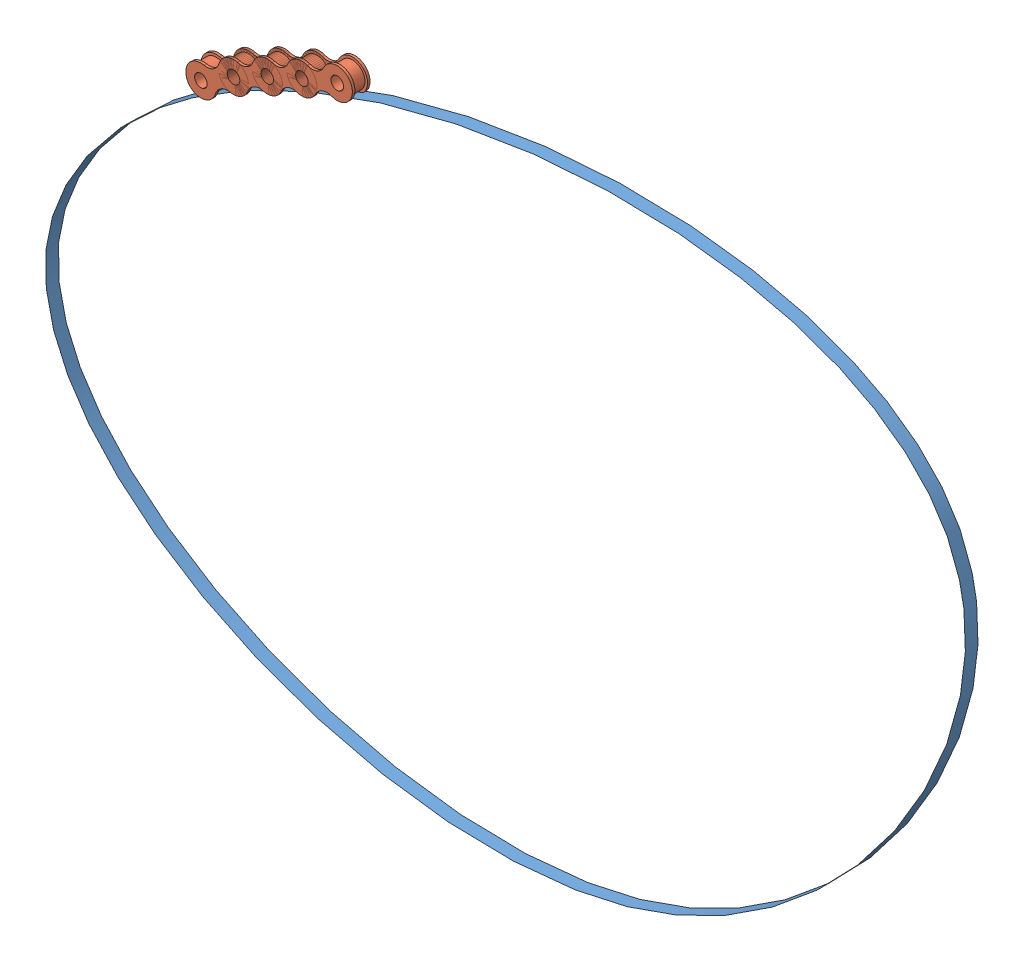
SolidWorks assembly kette.SLDASM, configuration Standard (file format 3400). Lengths in mm.
Overall size (516.33 352.17 7).
5 component instances, 2 part files, 12 mates.
Components (placement in the parent):
- BAHN-1: BAHN.SLDPRT [Standard] at (-3.7535 106.7741 0) size (516.33 352.17 5)
- KETTENGLIED-1: KETTENGLIED.SLDPRT [Standard] at (-120.4671 168.6904 3.5) x (0.860014 0.51027 0) z (0 0 1) size (27 12 7)
- KETTENGLIED-2: KETTENGLIED.SLDPRT [Standard] at (-107.5669 176.3444 3.5) x (0.889024 0.457861 0) z (0 0 1) size (27 12 7)
- KETTENGLIED-3: KETTENGLIED.SLDPRT [Standard] at (-94.2316 183.2123 3.5) x (0.912863 0.408267 0) z (0 0 1) size (27 12 7)
- KETTENGLIED-4: KETTENGLIED.SLDPRT [Standard] at (-80.5386 189.3363 3.5) x (0.932534 0.361081 0) z (0 0 1) size (27 12 7)
Mates (geometry in assembly coordinates):
- Deckungsgleich1: coincident anti-aligned: plane of KETTENGLIED-1 through (-102.2179 152.631 0) normal (0 0 -1)
- Deckungsgleich2: coincident anti-aligned: unknown of KETTENGLIED-2
- Deckungsgleich3: coincident anti-aligned: unknown of KETTENGLIED-3
- Deckungsgleich4: coincident anti-aligned: unknown of KETTENGLIED-4
- Konzentrisch1: concentric anti-aligned: cylinder of KETTENGLIED-3; cylinder of KETTENGLIED-4
- Konzentrisch2: concentric anti-aligned: cylinder of KETTENGLIED-2; cylinder of KETTENGLIED-3
- Konzentrisch3: concentric anti-aligned: cylinder of KETTENGLIED-1; cylinder of KETTENGLIED-2
- Tangential1: tangent: face of BAHN-1; cylinder of KETTENGLIED-1
- Tangential2: tangent: face of BAHN-1; cylinder of KETTENGLIED-2
- Tangential4: tangent: face of BAHN-1; cylinder of KETTENGLIED-2
- Tangential5: tangent: face of BAHN-1; cylinder of KETTENGLIED-4
- Tangential6: tangent: face of BAHN-1; cylinder of KETTENGLIED-4
